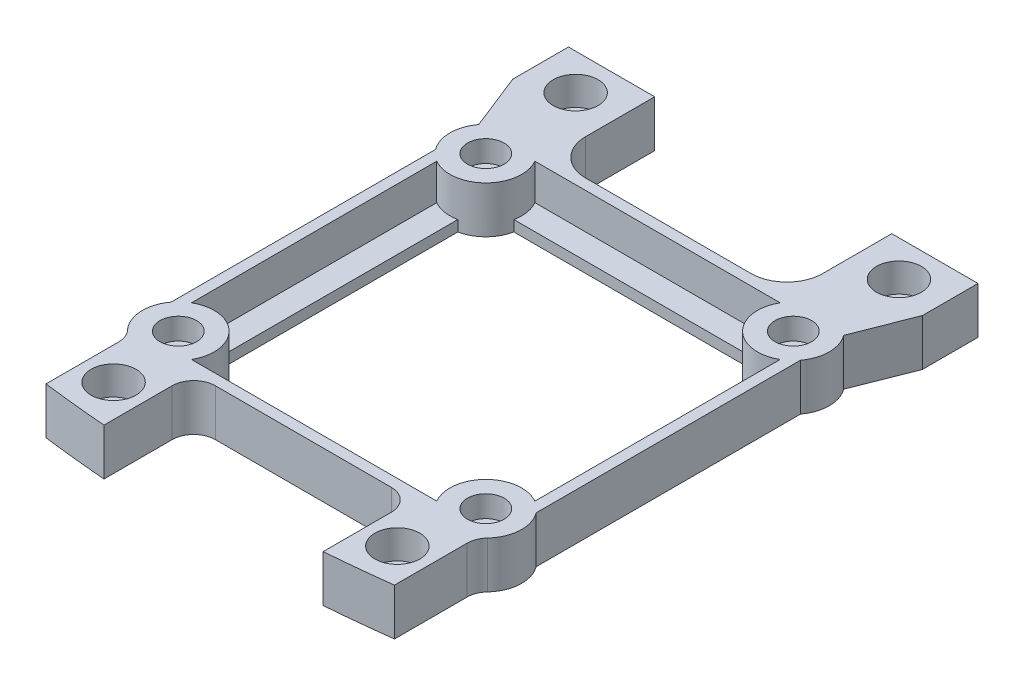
from build123d import *

# Parameters (mm, degrees)
SKETCH1_W           = 50.8
SKETCH1_H           = 50.8
SKETCH1_R           = 1.375
SKETCH1_W_2         = 40.8
SKETCH1_H_2         = 40.8
BOSS_EXTRUDE1_DEPTH = 1.5
SKETCH2_W           = 50.8
SKETCH2_H           = 50.8
SKETCH2_W_2         = 47.8
SKETCH2_H_2         = 47.8
BOSS_EXTRUDE2_DEPTH = 5
FILLET2_R           = 3
BOSS_EXTRUDE3_REACH = 38.504
SKETCH5_R           = 5
SKETCH5_R_2         = 1.375
SKETCH6_R           = 2.55
CUT_EXTRUDE1_DEPTH  = 3
SKETCH7_R           = 1.55
BOSS_EXTRUDE4_DEPTH = 6.5
SKETCH8_R           = 3.125
CUT_EXTRUDE2_DEPTH  = 4
FILLET3_R           = 5
BOSS_EXTRUDE5_DEPTH = 6.5
SKETCH10_R          = 3.125
CUT_EXTRUDE3_DEPTH  = 4
SKETCH11_R          = 1.55
CUT_EXTRUDE4_DEPTH  = 50.27727671
FILLET4_R           = 3


with BuildPart() as part:
    # Sketch1 → Boss-Extrude1 (new body)
    with BuildSketch(Plane(origin=(0, 0, 0), x_dir=(1, 0, 0), z_dir=(0, 1, 0))):
        Rectangle(SKETCH1_W, SKETCH1_H)
        with Locations(Location((-21.4, 21.4, 0), (0, 0, 270))):
            Circle(SKETCH1_R, mode=Mode.SUBTRACT)
        with Locations(Location((21.4, 21.4, 0), (0, 0, 270))):
            Circle(SKETCH1_R, mode=Mode.SUBTRACT)
        with Locations(Location((21.4, -21.4, 0), (0, 0, 270))):
            Circle(SKETCH1_R, mode=Mode.SUBTRACT)
        with Locations(Location((-21.4, -21.4, 0), (0, 0, 270))):
            Circle(SKETCH1_R, mode=Mode.SUBTRACT)
        Rectangle(SKETCH1_W_2, SKETCH1_H_2, mode=Mode.SUBTRACT)
    extrude(amount=BOSS_EXTRUDE1_DEPTH)

    # Sketch2 → Boss-Extrude2 (add)
    with BuildSketch(Plane(origin=(0, 1.5, 0), x_dir=(1, 0, 0), z_dir=(0, 1, 0))):
        Rectangle(SKETCH2_W, SKETCH2_H)
        Rectangle(SKETCH2_W_2, SKETCH2_H_2, mode=Mode.SUBTRACT)
    extrude(amount=BOSS_EXTRUDE2_DEPTH)

    # Fillet2
    fillet2_edges = [part.edges().sort_by_distance(p)[0] for p in [
        (23.9, 4, -23.9),
        (-23.9, 4, -23.9),
        (-23.9, 4, 23.9),
        (23.9, 4, 23.9),
        (25.4, 3.25, 25.4),
        (-25.4, 3.25, 25.4),
        (-25.4, 3.25, -25.4),
        (25.4, 3.25, -25.4),
    ]]
    fillet(fillet2_edges, radius=FILLET2_R)

    # Boss-Extrude3: up to this face of the body (flat: up to its plane)
    boss_extrude3_end = Plane(part.part.faces().sort_by_distance((0, 0, -24.68157951))[0])
    # Sketch5 → Boss-Extrude3 (add, up to the picked face)
    with BuildSketch(Plane(origin=(0, 6.5, 0), x_dir=(1, 0, 0), z_dir=(0, 1, 0)), mode=Mode.PRIVATE) as boss_extrude3_sk1:
        with Locations((-21.4, 21.4)):
            Circle(SKETCH5_R)
        with Locations(Location((-21.4, 21.4, 0), (0, 0, 270))):
            Circle(SKETCH5_R_2, mode=Mode.SUBTRACT)
    boss_extrude3_tool1 = split(extrude(boss_extrude3_sk1.sketch, amount=-BOSS_EXTRUDE3_REACH, mode=Mode.PRIVATE), bisect_by=boss_extrude3_end, keep=Keep.BOTH, mode=Mode.PRIVATE)
    # Sketch5 → Boss-Extrude3 (add, up to the picked face)
    with BuildSketch(Plane(origin=(0, 6.5, 0), x_dir=(1, 0, 0), z_dir=(0, 1, 0)), mode=Mode.PRIVATE) as boss_extrude3_sk2:
        with Locations((21.4, 21.4)):
            Circle(SKETCH5_R)
        with Locations(Location((21.4, 21.4, 0), (0, 0, 270))):
            Circle(SKETCH5_R_2, mode=Mode.SUBTRACT)
    boss_extrude3_tool2 = split(extrude(boss_extrude3_sk2.sketch, amount=-BOSS_EXTRUDE3_REACH, mode=Mode.PRIVATE), bisect_by=boss_extrude3_end, keep=Keep.BOTH, mode=Mode.PRIVATE)
    # Sketch5 → Boss-Extrude3 (add, up to the picked face)
    with BuildSketch(Plane(origin=(0, 6.5, 0), x_dir=(1, 0, 0), z_dir=(0, 1, 0)), mode=Mode.PRIVATE) as boss_extrude3_sk3:
        with Locations((21.4, -21.4)):
            Circle(SKETCH5_R)
        with Locations(Location((21.4, -21.4, 0), (0, 0, 270))):
            Circle(SKETCH5_R_2, mode=Mode.SUBTRACT)
    boss_extrude3_tool3 = split(extrude(boss_extrude3_sk3.sketch, amount=-BOSS_EXTRUDE3_REACH, mode=Mode.PRIVATE), bisect_by=boss_extrude3_end, keep=Keep.BOTH, mode=Mode.PRIVATE)
    # Sketch5 → Boss-Extrude3 (add, up to the picked face)
    with BuildSketch(Plane(origin=(0, 6.5, 0), x_dir=(1, 0, 0), z_dir=(0, 1, 0)), mode=Mode.PRIVATE) as boss_extrude3_sk4:
        with Locations((-21.4, -21.4)):
            Circle(SKETCH5_R)
        with Locations(Location((-21.4, -21.4, 0), (0, 0, 270))):
            Circle(SKETCH5_R_2, mode=Mode.SUBTRACT)
    boss_extrude3_tool4 = split(extrude(boss_extrude3_sk4.sketch, amount=-BOSS_EXTRUDE3_REACH, mode=Mode.PRIVATE), bisect_by=boss_extrude3_end, keep=Keep.BOTH, mode=Mode.PRIVATE)
    add(boss_extrude3_tool1.solids().sort_by(Axis((-26.258579, 6.5, -21.4), (0, -1, 0)))[0])
    add(boss_extrude3_tool2.solids().sort_by(Axis((16.541421, 6.5, -21.4), (0, -1, 0)))[0])
    add(boss_extrude3_tool3.solids().sort_by(Axis((16.541421, 6.5, 21.4), (0, -1, 0)))[0])
    add(boss_extrude3_tool4.solids().sort_by(Axis((-26.258579, 6.5, 21.4), (0, -1, 0)))[0])

    # Sketch6 → Cut-Extrude1 (cut)
    with BuildSketch(Plane(origin=(0, 6.5, 0), x_dir=(1, 0, 0), z_dir=(0, 1, 0))):
        with Locations(Location((-21.4, 21.4, 0), (0, 0, 270))):
            Circle(SKETCH6_R)
        with Locations(Location((21.4, 21.4, 0), (0, 0, 270))):
            Circle(SKETCH6_R)
        with Locations(Location((-21.4, -21.4, 0), (0, 0, 270))):
            Circle(SKETCH6_R)
        with Locations(Location((21.4, -21.4, 0), (0, 0, 270))):
            Circle(SKETCH6_R)
    extrude(amount=-CUT_EXTRUDE1_DEPTH, mode=Mode.SUBTRACT)

    # Sketch7 → Boss-Extrude4 (add)
    with BuildSketch(Plane(origin=(0, 6.5, 0), x_dir=(1, 0, 0), z_dir=(0, 1, 0))):
        with BuildLine():
            Line((16.5, 25.4), (16.5, 40))
            Line((16.5, 40), (28.5, 40))
            Line((28.5, 40), (28.5, 32.25))
            Line((28.5, 32.25), (25.4, 24.4))
            ThreePointArc((25.4, 24.4), (22.107106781, 26.349747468), (18.4, 25.4))
            Line((18.4, 25.4), (16.5, 25.4))
        make_face()
        with Locations(Location((22.5, 35, 0), (0, 0, 270))):
            Circle(SKETCH7_R, mode=Mode.SUBTRACT)
    boss_extrude4 = extrude(amount=-BOSS_EXTRUDE4_DEPTH)

    # Sketch8 → Cut-Extrude2 (cut)
    with BuildSketch(Plane(origin=(0, 6.5, 0), x_dir=(1, 0, 0), z_dir=(0, 1, 0))):
        with Locations(Location((22.5, 35, 0), (0, 0, 270))):
            Circle(SKETCH8_R)
    cut_extrude2 = extrude(amount=-CUT_EXTRUDE2_DEPTH, mode=Mode.SUBTRACT)

    # Mirror1: Boss-Extrude4, Cut-Extrude2 across plane
    add(boss_extrude4.mirror(Plane(origin=(0, 0, 0), x_dir=(0, 0, 1), z_dir=(1, 0, 0))))
    add(cut_extrude2.mirror(Plane(origin=(0, 0, 0), x_dir=(0, 0, 1), z_dir=(1, 0, 0))), mode=Mode.SUBTRACT)

    # Fillet3
    fillet3_edges = [part.edges().sort_by_distance(p)[0] for p in [
        (16.5, 3.25, -25.4),
        (-16.5, 3.25, -25.4),
    ]]
    fillet(fillet3_edges, radius=FILLET3_R)

    # Sketch9 → Boss-Extrude5 (add)
    with BuildSketch(Plane(origin=(0, 6.5, 0), x_dir=(1, 0, 0), z_dir=(0, 1, 0))):
        with BuildLine():
            Line((-24.25, -25.50822346), (-24.25, -36.962430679))
            ThreePointArc((-24.25, -36.962430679), (-19.755484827, -37.480943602), (-15.25, -37.893410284))
            Line((-15.25, -37.893410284), (-15.25, -25.4))
            Line((-15.25, -25.4), (-18.4, -25.4))
            ThreePointArc((-18.4, -25.4), (-21.30751714, -26.399144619), (-24.25, -25.50822346))
        make_face()
    boss_extrude5 = extrude(amount=-BOSS_EXTRUDE5_DEPTH)

    # Sketch10 → Cut-Extrude3 (cut)
    with BuildSketch(Plane(origin=(0, 6.5, 0), x_dir=(1, 0, 0), z_dir=(0, 1, 0))):
        with Locations(Location((-19.75, -32.06, 0), (0, 0, 270))):
            Circle(SKETCH10_R)
    cut_extrude3 = extrude(amount=-CUT_EXTRUDE3_DEPTH, mode=Mode.SUBTRACT)

    # Sketch11 → Cut-Extrude4 (cut, through all)
    with BuildSketch(Plane(origin=(0, 2.5, 0), x_dir=(1, 0, 0), z_dir=(0, 1, 0))):
        with Locations(Location((-19.75, -32.06, 0), (0, 0, 270))):
            Circle(SKETCH11_R)
    cut_extrude4 = extrude(amount=-CUT_EXTRUDE4_DEPTH, mode=Mode.SUBTRACT)

    # Mirror2: Boss-Extrude5, Cut-Extrude3, Cut-Extrude4 across plane
    add(boss_extrude5.mirror(Plane(origin=(0, 0, 0), x_dir=(0, 0, 1), z_dir=(1, 0, 0))))
    add(cut_extrude3.mirror(Plane(origin=(0, 0, 0), x_dir=(0, 0, 1), z_dir=(1, 0, 0))), mode=Mode.SUBTRACT)
    add(cut_extrude4.mirror(Plane(origin=(0, 0, 0), x_dir=(0, 0, 1), z_dir=(1, 0, 0))), mode=Mode.SUBTRACT)

    # Fillet4
    fillet4_edges = [part.edges().sort_by_distance(p)[0] for p in [
        (-24.25, 3.25, 25.50822346),
        (-15.25, 3.25, 25.4),
        (15.25, 3.25, 25.4),
        (24.25, 3.25, 25.50822346),
    ]]
    fillet(fillet4_edges, radius=FILLET4_R)


solid = part.part
